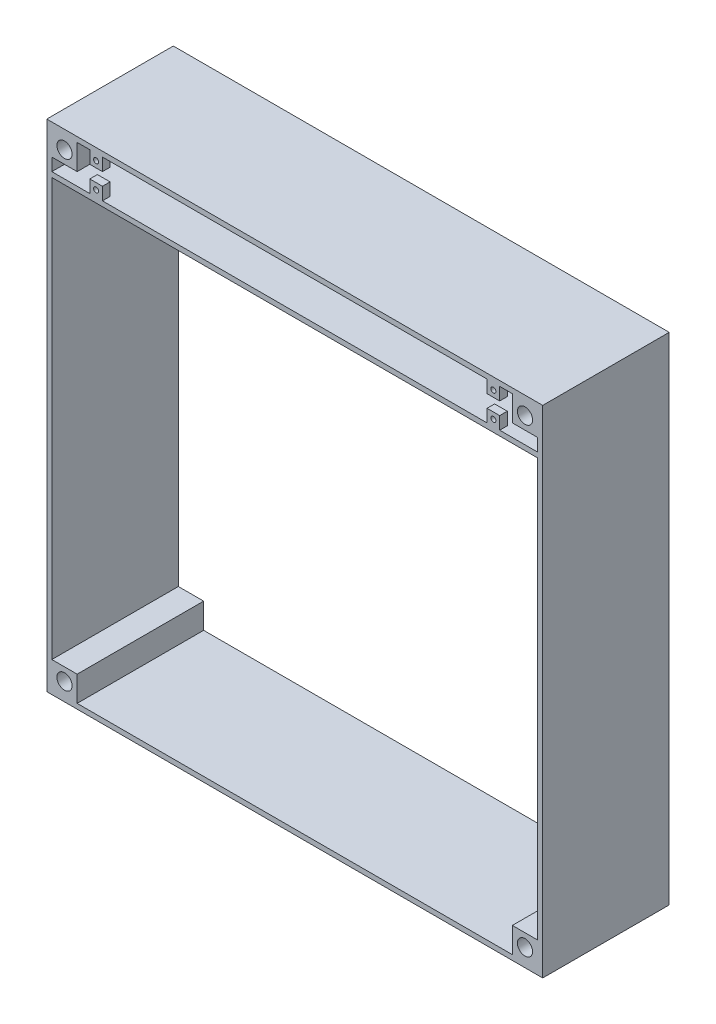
from build123d import *

# Parameters (mm, degrees)
SKETCH1_W           = 248.92
SKETCH1_H           = 248.92
SKETCH1_W_2         = 243.84
SKETCH1_H_2         = 243.84
BOSS_EXTRUDE1_DEPTH = 31.75
SKETCH2_W           = 243.84
SKETCH2_H           = 2.54
EXTRUDE_THIN1_DEPTH = 31.75
SKETCH4_R           = 6.35
CUT_EXTRUDE1_DEPTH  = 2.54
SKETCH5_W           = 6.35
SKETCH5_H           = 6.35
SKETCH5_R           = 1.27
BOSS_EXTRUDE2_DEPTH = 3.81
SKETCH6_W           = 12.7
SKETCH6_H           = 12.7
SKETCH6_R           = 3.81
BOSS_EXTRUDE3_DEPTH = 31.75


with BuildPart() as part:
    # Sketch1 → Boss-Extrude1 (new, symmetric)
    with BuildSketch(Plane.XY):
        with Locations((124.46, 124.46)):
            Rectangle(SKETCH1_W, SKETCH1_H)
        with Locations((124.46, 124.46)):
            Rectangle(SKETCH1_W_2, SKETCH1_H_2, mode=Mode.SUBTRACT)
    extrude(amount=BOSS_EXTRUDE1_DEPTH, both=True)

    # Sketch2 → Extrude-Thin1 (add, symmetric)
    with BuildSketch(Plane.XY):
        with Locations((124.46, 226.06)):
            Rectangle(SKETCH2_W, SKETCH2_H)
    extrude(amount=EXTRUDE_THIN1_DEPTH, both=True)

    # Sketch4 → Cut-Extrude1 (cut)
    with BuildSketch(Plane.XZ.offset(-224.79)):
        with BuildLine():
            ThreePointArc((102.843494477, 0), (93.98, 8.863494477), (85.116505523, 0))
            Line((85.116505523, 0), (102.843494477, 0))
        make_face()
        with BuildLine():
            Line((102.843494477, 0), (85.116505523, 0))
            ThreePointArc((85.116505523, 0), (93.98, -8.863494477), (102.843494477, 0))
        make_face()
        with BuildLine():
            ThreePointArc((102.843494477, 0), (93.98, 8.863494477), (85.116505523, 0))
            Line((85.116505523, 0), (102.843494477, 0))
        make_face()
        with BuildLine():
            Line((102.843494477, 0), (85.116505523, 0))
            ThreePointArc((85.116505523, 0), (93.98, -8.863494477), (102.843494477, 0))
        make_face()
        with BuildLine():
            ThreePointArc((163.160230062, 0), (154.94, 8.220230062), (146.719769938, 0))
            Line((146.719769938, 0), (163.160230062, 0))
        make_face()
        with BuildLine():
            Line((163.160230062, 0), (146.719769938, 0))
            ThreePointArc((146.719769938, 0), (154.94, -8.220230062), (163.160230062, 0))
        make_face()
        with BuildLine():
            ThreePointArc((163.160230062, 0), (154.94, 8.220230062), (146.719769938, 0))
            Line((146.719769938, 0), (163.160230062, 0))
        make_face()
        with BuildLine():
            Line((163.160230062, 0), (146.719769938, 0))
            ThreePointArc((146.719769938, 0), (154.94, -8.220230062), (163.160230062, 0))
        make_face()
        with Locations(Location((33.02, 0, 0), (0, 0, 270))):
            Circle(SKETCH4_R)
        with Locations(Location((215.9, 0, 0), (0, 0, 270))):
            Circle(SKETCH4_R)
    extrude(amount=-CUT_EXTRUDE1_DEPTH, mode=Mode.SUBTRACT)

    # Sketch5 → Boss-Extrude2 (add)
    # profile 1 of 4: a face of its own
    with BuildSketch(Plane.XY.offset(31.75)):
        with Locations((24.765, 230.505)):
            Rectangle(SKETCH5_W, SKETCH5_H)
        with Locations((24.765, 230.505)):
            Circle(SKETCH5_R, mode=Mode.SUBTRACT)
    # profile 2 of 4: a face of its own
    with BuildSketch(Plane.XY.offset(31.75)):
        with Locations((224.155, 230.505)):
            Rectangle(SKETCH5_W, SKETCH5_H)
        with Locations((224.155, 230.505)):
            Circle(SKETCH5_R, mode=Mode.SUBTRACT)
    # profile 3 of 4: a face of its own
    with BuildSketch(Plane.XY.offset(31.75)):
        with Locations((24.765, 243.205)):
            Rectangle(SKETCH5_W, SKETCH5_H)
        with Locations((24.765, 243.205)):
            Circle(SKETCH5_R, mode=Mode.SUBTRACT)
    # profile 4 of 4: a face of its own
    with BuildSketch(Plane.XY.offset(31.75)):
        with Locations((224.155, 243.205)):
            Rectangle(SKETCH5_W, SKETCH5_H)
        with Locations((224.155, 243.205)):
            Circle(SKETCH5_R, mode=Mode.SUBTRACT)
    boss_extrude2 = extrude(amount=-BOSS_EXTRUDE2_DEPTH)

    # Mirror1: Boss-Extrude2 across plane
    add(boss_extrude2.mirror(Plane.XY))

    # Sketch6 → Boss-Extrude3 (add, symmetric)
    # profile 1 of 4: a face of its own
    with BuildSketch(Plane.XY):
        with Locations((240.03, 240.03)):
            Rectangle(SKETCH6_W, SKETCH6_H)
        with Locations((240.03, 240.03)):
            Circle(SKETCH6_R, mode=Mode.SUBTRACT)
    # profile 2 of 4: a face of its own
    with BuildSketch(Plane.XY):
        with Locations((8.89, 8.89)):
            Rectangle(SKETCH6_W, SKETCH6_H)
        with Locations((8.89, 8.89)):
            Circle(SKETCH6_R, mode=Mode.SUBTRACT)
    # profile 3 of 4: a face of its own
    with BuildSketch(Plane.XY):
        with Locations((240.03, 8.89)):
            Rectangle(SKETCH6_W, SKETCH6_H)
        with Locations((240.03, 8.89)):
            Circle(SKETCH6_R, mode=Mode.SUBTRACT)
    # profile 4 of 4: a face of its own
    with BuildSketch(Plane.XY):
        with Locations((8.89, 240.03)):
            Rectangle(SKETCH6_W, SKETCH6_H)
        with Locations((8.89, 240.03)):
            Circle(SKETCH6_R, mode=Mode.SUBTRACT)
    extrude(amount=BOSS_EXTRUDE3_DEPTH, both=True)


solid = part.part
